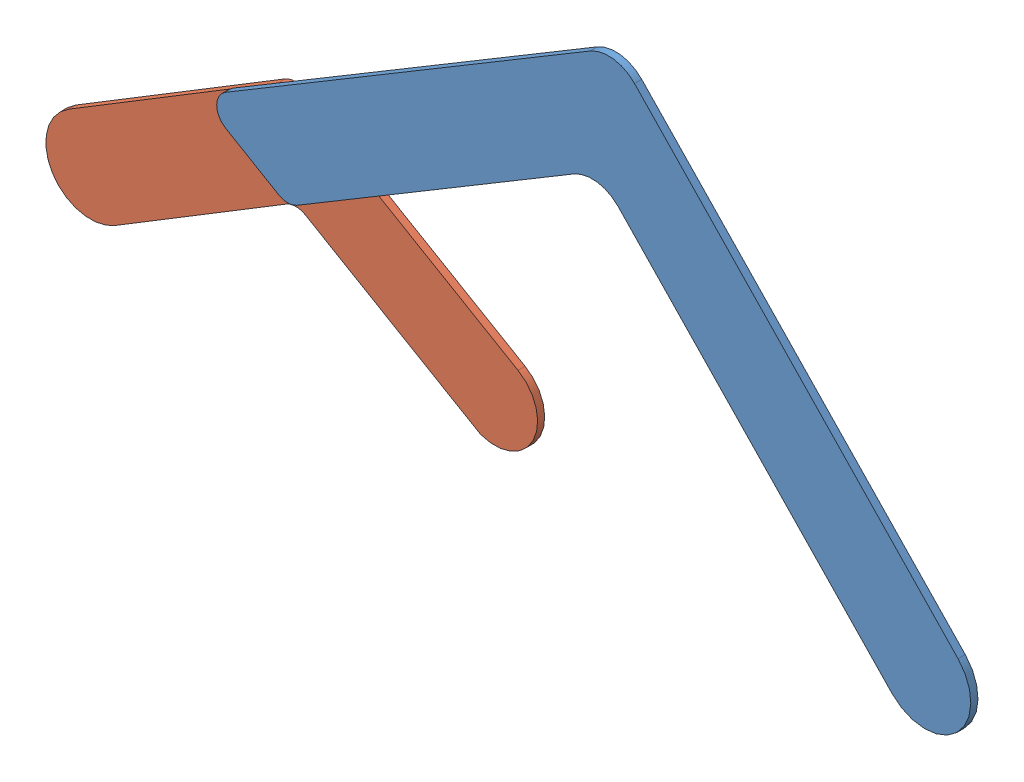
SolidWorks assembly baugruppe3.SLDASM, configuration Standard (file format 11000). Lengths in mm.
Overall size (612.71 280.79 13.26).
2 component instances, 2 part files, 1 mates.
Components (placement in the parent):
- teilgross-1: teilgross.SLDPRT [Standard] at (-1273.7218 -307.6103 425.5306) size (498.51 280.79 4.76)
- teilklein-1: teilklein.SLDPRT [Standard] at (-1311.4052 -321.0517 425.6654) x (0.999817 -0.000109 -0.019123) z (0.019123 0.011438 0.999752) size (319.09 138.76 4.76)
Mates (geometry in assembly coordinates):
- Parallel1: parallel: plane of teilgross-1 through (-1344.8843 -211.7059 429.9106) normal (-0.51331 0.858203 0); plane of teilklein-1 through (-1373.1965 -228.8417 421.4113) normal (-0.51331 0.858203 0)
